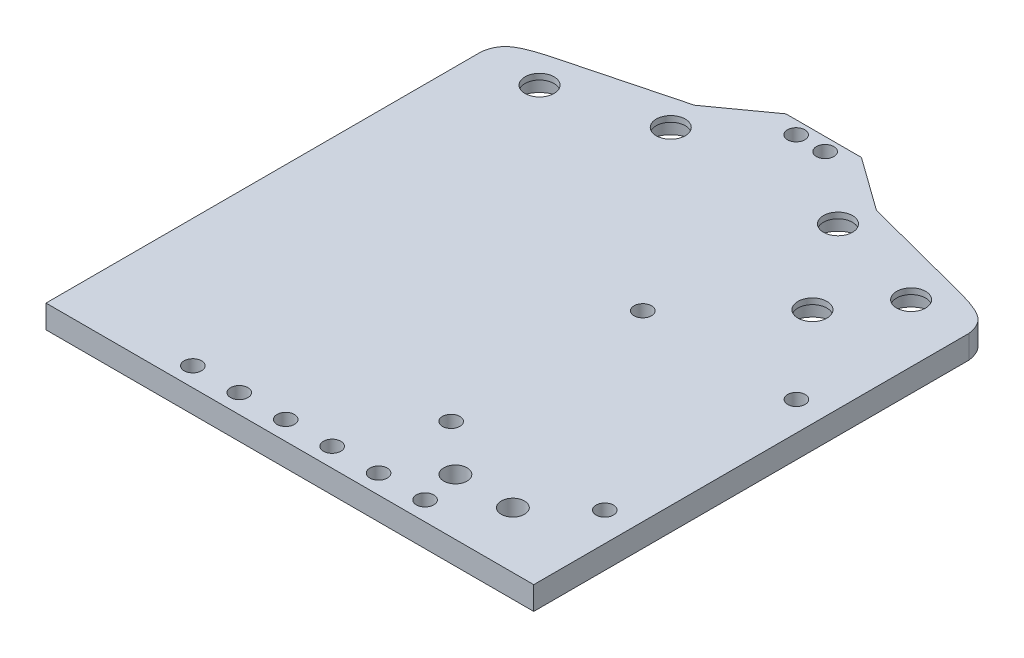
ISO-10303-21;
HEADER;
FILE_DESCRIPTION(('STEP AP214'),'2;1');
FILE_NAME('part.step','',(''),(''),'','','');
FILE_SCHEMA(('AUTOMOTIVE_DESIGN { 1 0 10303 214 1 1 1 1 }'));
ENDSEC;
DATA;
#1=APPLICATION_CONTEXT('core data for automotive mechanical design processes');
#2=APPLICATION_PROTOCOL_DEFINITION('international standard','automotive_design',2000,#1);
#3=PRODUCT_CONTEXT('',#1,'mechanical');
#4=PRODUCT('Part','Part','',(#3));
#5=PRODUCT_RELATED_PRODUCT_CATEGORY('part','',(#4));
#6=PRODUCT_DEFINITION_FORMATION('','',#4);
#7=PRODUCT_DEFINITION_CONTEXT('part definition',#1,'design');
#8=PRODUCT_DEFINITION('design','',#6,#7);
#9=PRODUCT_DEFINITION_SHAPE('','',#8);
#10=(LENGTH_UNIT() NAMED_UNIT(*) SI_UNIT(.MILLI.,.METRE.));
#11=(NAMED_UNIT(*) PLANE_ANGLE_UNIT() SI_UNIT($,.RADIAN.));
#12=(NAMED_UNIT(*) SI_UNIT($,.STERADIAN.) SOLID_ANGLE_UNIT());
#13=UNCERTAINTY_MEASURE_WITH_UNIT(LENGTH_MEASURE(1.E-05),#10,'distance_accuracy_value','');
#14=(GEOMETRIC_REPRESENTATION_CONTEXT(3) GLOBAL_UNCERTAINTY_ASSIGNED_CONTEXT((#13)) GLOBAL_UNIT_ASSIGNED_CONTEXT((#10,
#11,#12)) REPRESENTATION_CONTEXT('',''));
#15=CARTESIAN_POINT('',(0.,0.,0.));
#16=DIRECTION('',(0.,0.,1.));
#17=DIRECTION('',(1.,0.,0.));
#18=AXIS2_PLACEMENT_3D('',#15,#16,#17);
#19=CARTESIAN_POINT('',(0.,0.,0.));
#20=DIRECTION('',(0.,1.,0.));
#21=DIRECTION('',(0.,0.,1.));
#22=AXIS2_PLACEMENT_3D('',#19,#20,#21);
#23=PLANE('',#22);
#24=CARTESIAN_POINT('',(18.82,0.,70.31));
#25=DIRECTION('',(0.,-1.,0.));
#26=DIRECTION('',(0.,0.,-1.));
#27=AXIS2_PLACEMENT_3D('',#24,#25,#26);
#28=CIRCLE('',#27,2.);
#29=CARTESIAN_POINT('',(18.82,0.,68.31));
#30=VERTEX_POINT('',#29);
#31=EDGE_CURVE('E358',#30,#30,#28,.F.);
#32=ORIENTED_EDGE('',*,*,#31,.T.);
#33=EDGE_LOOP('',(#32));
#34=FACE_BOUND('',#33,.T.);
#35=CARTESIAN_POINT('',(28.72,0.,70.31));
#36=DIRECTION('',(0.,-1.,0.));
#37=DIRECTION('',(0.,0.,-1.));
#38=AXIS2_PLACEMENT_3D('',#35,#36,#37);
#39=CIRCLE('',#38,2.00000000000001);
#40=CARTESIAN_POINT('',(28.72,0.,68.31));
#41=VERTEX_POINT('',#40);
#42=EDGE_CURVE('E364',#41,#41,#39,.F.);
#43=ORIENTED_EDGE('',*,*,#42,.T.);
#44=EDGE_LOOP('',(#43));
#45=FACE_BOUND('',#44,.T.);
#46=CARTESIAN_POINT('',(37.0000000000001,0.,29.7600000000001));
#47=DIRECTION('',(0.,-1.,0.));
#48=DIRECTION('',(0.,0.,-1.));
#49=AXIS2_PLACEMENT_3D('',#46,#47,#48);
#50=CIRCLE('',#49,1.50000000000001);
#51=CARTESIAN_POINT('',(37.0000000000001,0.,28.2600000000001));
#52=VERTEX_POINT('',#51);
#53=EDGE_CURVE('E362',#52,#52,#50,.T.);
#54=ORIENTED_EDGE('',*,*,#53,.F.);
#55=EDGE_LOOP('',(#54));
#56=FACE_BOUND('',#55,.T.);
#57=CARTESIAN_POINT('',(10.54,0.,62.76));
#58=DIRECTION('',(0.,-1.,0.));
#59=DIRECTION('',(0.,0.,-1.));
#60=AXIS2_PLACEMENT_3D('',#57,#58,#59);
#61=CIRCLE('',#60,1.5);
#62=CARTESIAN_POINT('',(10.54,0.,61.26));
#63=VERTEX_POINT('',#62);
#64=EDGE_CURVE('E347',#63,#63,#61,.T.);
#65=ORIENTED_EDGE('',*,*,#64,.F.);
#66=EDGE_LOOP('',(#65));
#67=FACE_BOUND('',#66,.T.);
#68=CARTESIAN_POINT('',(-20.,0.,76.7166500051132));
#69=DIRECTION('',(0.,-1.,0.));
#70=DIRECTION('',(0.,0.,-1.));
#71=AXIS2_PLACEMENT_3D('',#68,#69,#70);
#72=CIRCLE('',#71,1.5);
#73=CARTESIAN_POINT('',(-20.,0.,75.2166500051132));
#74=VERTEX_POINT('',#73);
#75=EDGE_CURVE('E384',#74,#74,#72,.T.);
#76=ORIENTED_EDGE('',*,*,#75,.F.);
#77=EDGE_LOOP('',(#76));
#78=FACE_BOUND('',#77,.T.);
#79=CARTESIAN_POINT('',(-12.,0.,76.7166500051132));
#80=DIRECTION('',(0.,-1.,0.));
#81=DIRECTION('',(0.,0.,-1.));
#82=AXIS2_PLACEMENT_3D('',#79,#80,#81);
#83=CIRCLE('',#82,1.5);
#84=CARTESIAN_POINT('',(-12.,0.,75.2166500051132));
#85=VERTEX_POINT('',#84);
#86=EDGE_CURVE('E381',#85,#85,#83,.T.);
#87=ORIENTED_EDGE('',*,*,#86,.F.);
#88=EDGE_LOOP('',(#87));
#89=FACE_BOUND('',#88,.T.);
#90=CARTESIAN_POINT('',(-4.,0.,76.7166500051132));
#91=DIRECTION('',(0.,-1.,0.));
#92=DIRECTION('',(0.,0.,-1.));
#93=AXIS2_PLACEMENT_3D('',#90,#91,#92);
#94=CIRCLE('',#93,1.5);
#95=CARTESIAN_POINT('',(-4.,0.,75.2166500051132));
#96=VERTEX_POINT('',#95);
#97=EDGE_CURVE('E327',#96,#96,#94,.T.);
#98=ORIENTED_EDGE('',*,*,#97,.F.);
#99=EDGE_LOOP('',(#98));
#100=FACE_BOUND('',#99,.T.);
#101=CARTESIAN_POINT('',(32.,0.,5.));
#102=DIRECTION('',(0.,1.,0.));
#103=DIRECTION('',(0.,0.,1.));
#104=AXIS2_PLACEMENT_3D('',#101,#102,#103);
#105=CIRCLE('',#104,4.1);
#106=CARTESIAN_POINT('',(32.,0.,9.1));
#107=VERTEX_POINT('',#106);
#108=EDGE_CURVE('E409',#107,#107,#105,.F.);
#109=ORIENTED_EDGE('',*,*,#108,.F.);
#110=EDGE_LOOP('',(#109));
#111=FACE_BOUND('',#110,.T.);
#112=DIRECTION('',(-0.811997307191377,0.,-0.583661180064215));
#113=VECTOR('',#112,1.);
#114=CARTESIAN_POINT('',(7.87375522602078,0.,-10.9540744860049));
#115=LINE('',#114,#113);
#116=CARTESIAN_POINT('',(15.6674949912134,0.,-5.35195818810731));
#117=VERTEX_POINT('',#116);
#118=CARTESIAN_POINT('',(6.50166344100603,0.,-11.9403298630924));
#119=VERTEX_POINT('',#118);
#120=EDGE_CURVE('E298',#117,#119,#115,.T.);
#121=ORIENTED_EDGE('',*,*,#120,.F.);
#122=CARTESIAN_POINT('',(14.4,0.,0.));
#123=DIRECTION('',(0.,1.,0.));
#124=DIRECTION('',(0.,0.,1.));
#125=AXIS2_PLACEMENT_3D('',#122,#123,#124);
#126=CIRCLE('',#125,5.5);
#127=CARTESIAN_POINT('',(15.9139132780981,0.,-5.28753880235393));
#128=VERTEX_POINT('',#127);
#129=EDGE_CURVE('E296',#117,#128,#126,.F.);
#130=ORIENTED_EDGE('',*,*,#129,.T.);
#131=DIRECTION('',(-0.967486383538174,0.,-0.252923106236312));
#132=VECTOR('',#131,1.);
#133=CARTESIAN_POINT('',(2.31187354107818,0.,-8.84342361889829));
#134=LINE('',#133,#132);
#135=CARTESIAN_POINT('',(32.,0.,-1.0822671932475));
#136=VERTEX_POINT('',#135);
#137=EDGE_CURVE('E231',#136,#128,#134,.T.);
#138=ORIENTED_EDGE('',*,*,#137,.F.);
#139=CARTESIAN_POINT('',(32.,0.,-1.0822671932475));
#140=CARTESIAN_POINT('',(34.479638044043,0.,-0.458520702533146));
#141=CARTESIAN_POINT('',(39.7445832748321,0.,0.833673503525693));
#142=CARTESIAN_POINT('',(41.6503652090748,0.,2.84167312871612));
#143=CARTESIAN_POINT('',(42.,0.,4.99999999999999));
#144=B_SPLINE_CURVE_WITH_KNOTS('',3,(#139,#140,#141,#142,#143),.UNSPECIFIED.,.F.,.F.,(4,1,4),
(0.,0.499397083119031,1.),.UNSPECIFIED.);
#145=CARTESIAN_POINT('',(42.,0.,4.99999999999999));
#146=VERTEX_POINT('',#145);
#147=EDGE_CURVE('E287',#136,#146,#144,.T.);
#148=ORIENTED_EDGE('',*,*,#147,.T.);
#149=DIRECTION('',(0.,0.,1.));
#150=VECTOR('',#149,1.);
#151=CARTESIAN_POINT('',(42.,0.,0.));
#152=LINE('',#151,#150);
#153=CARTESIAN_POINT('',(42.,0.,80.));
#154=VERTEX_POINT('',#153);
#155=EDGE_CURVE('E284',#146,#154,#152,.T.);
#156=ORIENTED_EDGE('',*,*,#155,.T.);
#157=DIRECTION('',(1.,0.,0.));
#158=VECTOR('',#157,1.);
#159=CARTESIAN_POINT('',(0.,0.,80.));
#160=LINE('',#159,#158);
#161=CARTESIAN_POINT('',(-42.,0.,80.));
#162=VERTEX_POINT('',#161);
#163=EDGE_CURVE('E281',#162,#154,#160,.T.);
#164=ORIENTED_EDGE('',*,*,#163,.F.);
#165=DIRECTION('',(0.,0.,1.));
#166=VECTOR('',#165,1.);
#167=CARTESIAN_POINT('',(-42.,0.,0.));
#168=LINE('',#167,#166);
#169=CARTESIAN_POINT('',(-42.,0.,5.));
#170=VERTEX_POINT('',#169);
#171=EDGE_CURVE('E276',#170,#162,#168,.T.);
#172=ORIENTED_EDGE('',*,*,#171,.F.);
#173=CARTESIAN_POINT('',(-32.,0.,-1.08226719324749));
#174=CARTESIAN_POINT('',(-34.479638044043,0.,-0.458520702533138));
#175=CARTESIAN_POINT('',(-39.7445832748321,0.,0.833673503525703));
#176=CARTESIAN_POINT('',(-41.6503652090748,0.,2.84167312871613));
#177=CARTESIAN_POINT('',(-42.,0.,5.));
#178=B_SPLINE_CURVE_WITH_KNOTS('',3,(#173,#174,#175,#176,#177),.UNSPECIFIED.,.F.,.F.,(4,1,4),
(0.,0.499397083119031,1.),.UNSPECIFIED.);
#179=CARTESIAN_POINT('',(-32.,0.,-1.08226719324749));
#180=VERTEX_POINT('',#179);
#181=EDGE_CURVE('E272',#180,#170,#178,.T.);
#182=ORIENTED_EDGE('',*,*,#181,.F.);
#183=DIRECTION('',(0.967486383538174,0.,-0.252923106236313));
#184=VECTOR('',#183,1.);
#185=CARTESIAN_POINT('',(-2.31187354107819,0.,-8.8434236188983));
#186=LINE('',#185,#184);
#187=CARTESIAN_POINT('',(-15.6674949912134,0.,-5.35195818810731));
#188=VERTEX_POINT('',#187);
#189=EDGE_CURVE('E269',#180,#188,#186,.T.);
#190=ORIENTED_EDGE('',*,*,#189,.T.);
#191=DIRECTION('',(0.811997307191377,0.,-0.583661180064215));
#192=VECTOR('',#191,1.);
#193=CARTESIAN_POINT('',(-7.87375522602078,0.,-10.9540744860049));
#194=LINE('',#193,#192);
#195=CARTESIAN_POINT('',(-6.50166344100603,0.,-11.9403298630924));
#196=VERTEX_POINT('',#195);
#197=EDGE_CURVE('E265',#188,#196,#194,.T.);
#198=ORIENTED_EDGE('',*,*,#197,.T.);
#199=DIRECTION('',(1.,0.,0.));
#200=VECTOR('',#199,1.);
#201=CARTESIAN_POINT('',(0.,0.,-11.9403298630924));
#202=LINE('',#201,#200);
#203=EDGE_CURVE('E262',#196,#119,#202,.T.);
#204=ORIENTED_EDGE('',*,*,#203,.T.);
#205=EDGE_LOOP('',(#121,#130,#138,#148,#156,#164,#172,#182,#190,#198,#204));
#206=FACE_BOUND('',#205,.T.);
#207=CARTESIAN_POINT('',(-14.4,0.,0.));
#208=DIRECTION('',(0.,1.,0.));
#209=DIRECTION('',(0.,0.,1.));
#210=AXIS2_PLACEMENT_3D('',#207,#208,#209);
#211=CIRCLE('',#210,4.1);
#212=CARTESIAN_POINT('',(-14.4,0.,4.1));
#213=VERTEX_POINT('',#212);
#214=EDGE_CURVE('E427',#213,#213,#211,.T.);
#215=ORIENTED_EDGE('',*,*,#214,.T.);
#216=EDGE_LOOP('',(#215));
#217=FACE_BOUND('',#216,.T.);
#218=CARTESIAN_POINT('',(14.4,0.,0.));
#219=DIRECTION('',(0.,-1.,0.));
#220=DIRECTION('',(0.,0.,-1.));
#221=AXIS2_PLACEMENT_3D('',#218,#219,#220);
#222=CIRCLE('',#221,4.1);
#223=CARTESIAN_POINT('',(14.4,0.,-4.1));
#224=VERTEX_POINT('',#223);
#225=EDGE_CURVE('E417',#224,#224,#222,.T.);
#226=ORIENTED_EDGE('',*,*,#225,.F.);
#227=EDGE_LOOP('',(#226));
#228=FACE_BOUND('',#227,.T.);
#229=CARTESIAN_POINT('',(25.,0.,15.));
#230=DIRECTION('',(0.,1.,0.));
#231=DIRECTION('',(0.,0.,1.));
#232=AXIS2_PLACEMENT_3D('',#229,#230,#231);
#233=CIRCLE('',#232,4.1);
#234=CARTESIAN_POINT('',(25.,0.,19.1));
#235=VERTEX_POINT('',#234);
#236=EDGE_CURVE('E432',#235,#235,#233,.T.);
#237=ORIENTED_EDGE('',*,*,#236,.T.);
#238=EDGE_LOOP('',(#237));
#239=FACE_BOUND('',#238,.T.);
#240=CARTESIAN_POINT('',(-32.,0.,5.));
#241=DIRECTION('',(0.,1.,0.));
#242=DIRECTION('',(0.,0.,1.));
#243=AXIS2_PLACEMENT_3D('',#240,#241,#242);
#244=CIRCLE('',#243,4.1);
#245=CARTESIAN_POINT('',(-32.,0.,9.1));
#246=VERTEX_POINT('',#245);
#247=EDGE_CURVE('E424',#246,#246,#244,.T.);
#248=ORIENTED_EDGE('',*,*,#247,.T.);
#249=EDGE_LOOP('',(#248));
#250=FACE_BOUND('',#249,.T.);
#251=CARTESIAN_POINT('',(2.5,0.,-9.69032986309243));
#252=DIRECTION('',(0.,1.,0.));
#253=DIRECTION('',(0.,0.,1.));
#254=AXIS2_PLACEMENT_3D('',#251,#252,#253);
#255=CIRCLE('',#254,1.50083412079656);
#256=CARTESIAN_POINT('',(2.5,0.,-8.18949574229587));
#257=VERTEX_POINT('',#256);
#258=EDGE_CURVE('E404',#257,#257,#255,.F.);
#259=ORIENTED_EDGE('',*,*,#258,.F.);
#260=EDGE_LOOP('',(#259));
#261=FACE_BOUND('',#260,.T.);
#262=CARTESIAN_POINT('',(-2.5,0.,-9.69032986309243));
#263=DIRECTION('',(0.,1.,0.));
#264=DIRECTION('',(0.,0.,1.));
#265=AXIS2_PLACEMENT_3D('',#262,#263,#264);
#266=CIRCLE('',#265,1.50083412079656);
#267=CARTESIAN_POINT('',(-2.5,0.,-8.18949574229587));
#268=VERTEX_POINT('',#267);
#269=EDGE_CURVE('E397',#268,#268,#266,.T.);
#270=ORIENTED_EDGE('',*,*,#269,.T.);
#271=EDGE_LOOP('',(#270));
#272=FACE_BOUND('',#271,.T.);
#273=CARTESIAN_POINT('',(12.,0.,76.7166500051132));
#274=DIRECTION('',(0.,1.,0.));
#275=DIRECTION('',(0.,0.,1.));
#276=AXIS2_PLACEMENT_3D('',#273,#274,#275);
#277=CIRCLE('',#276,1.5);
#278=CARTESIAN_POINT('',(12.,0.,78.2166500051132));
#279=VERTEX_POINT('',#278);
#280=EDGE_CURVE('E385',#279,#279,#277,.T.);
#281=ORIENTED_EDGE('',*,*,#280,.T.);
#282=EDGE_LOOP('',(#281));
#283=FACE_BOUND('',#282,.T.);
#284=CARTESIAN_POINT('',(4.,0.,76.7166500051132));
#285=DIRECTION('',(0.,-1.,0.));
#286=DIRECTION('',(0.,0.,-1.));
#287=AXIS2_PLACEMENT_3D('',#284,#285,#286);
#288=CIRCLE('',#287,1.5);
#289=CARTESIAN_POINT('',(4.,0.,75.2166500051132));
#290=VERTEX_POINT('',#289);
#291=EDGE_CURVE('E388',#290,#290,#288,.F.);
#292=ORIENTED_EDGE('',*,*,#291,.T.);
#293=EDGE_LOOP('',(#292));
#294=FACE_BOUND('',#293,.T.);
#295=CARTESIAN_POINT('',(20.,0.,76.7166500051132));
#296=DIRECTION('',(0.,1.,0.));
#297=DIRECTION('',(0.,0.,1.));
#298=AXIS2_PLACEMENT_3D('',#295,#296,#297);
#299=CIRCLE('',#298,1.5);
#300=CARTESIAN_POINT('',(20.,0.,78.2166500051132));
#301=VERTEX_POINT('',#300);
#302=EDGE_CURVE('E355',#301,#301,#299,.T.);
#303=ORIENTED_EDGE('',*,*,#302,.T.);
#304=EDGE_LOOP('',(#303));
#305=FACE_BOUND('',#304,.T.);
#306=CARTESIAN_POINT('',(37.,0.,62.76));
#307=DIRECTION('',(0.,-1.,0.));
#308=DIRECTION('',(0.,0.,-1.));
#309=AXIS2_PLACEMENT_3D('',#306,#307,#308);
#310=CIRCLE('',#309,1.5);
#311=CARTESIAN_POINT('',(37.,0.,61.26));
#312=VERTEX_POINT('',#311);
#313=EDGE_CURVE('E373',#312,#312,#310,.F.);
#314=ORIENTED_EDGE('',*,*,#313,.T.);
#315=EDGE_LOOP('',(#314));
#316=FACE_BOUND('',#315,.T.);
#317=CARTESIAN_POINT('',(10.5400000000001,0.,29.7599999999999));
#318=DIRECTION('',(0.,-1.,0.));
#319=DIRECTION('',(0.,0.,-1.));
#320=AXIS2_PLACEMENT_3D('',#317,#318,#319);
#321=CIRCLE('',#320,1.5);
#322=CARTESIAN_POINT('',(10.5400000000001,0.,28.2599999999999));
#323=VERTEX_POINT('',#322);
#324=EDGE_CURVE('E374',#323,#323,#321,.F.);
#325=ORIENTED_EDGE('',*,*,#324,.T.);
#326=EDGE_LOOP('',(#325));
#327=FACE_BOUND('',#326,.T.);
#328=ADVANCED_FACE('F135',(#34,#45,#56,#67,#78,#89,#100,#111,#206,#217,#228,#239,#250,#261,#272,
#283,#294,#305,#316,#327),#23,.F.);
#329=CARTESIAN_POINT('',(0.,4.,0.));
#330=DIRECTION('',(0.,1.,0.));
#331=DIRECTION('',(0.,0.,1.));
#332=AXIS2_PLACEMENT_3D('',#329,#330,#331);
#333=PLANE('',#332);
#334=CARTESIAN_POINT('',(18.82,4.,70.31));
#335=DIRECTION('',(0.,1.,0.));
#336=DIRECTION('',(0.,0.,1.));
#337=AXIS2_PLACEMENT_3D('',#334,#335,#336);
#338=CIRCLE('',#337,2.);
#339=CARTESIAN_POINT('',(18.82,4.,72.31));
#340=VERTEX_POINT('',#339);
#341=EDGE_CURVE('E139',#340,#340,#338,.F.);
#342=ORIENTED_EDGE('',*,*,#341,.T.);
#343=EDGE_LOOP('',(#342));
#344=FACE_BOUND('',#343,.T.);
#345=CARTESIAN_POINT('',(28.72,4.,70.31));
#346=DIRECTION('',(0.,1.,0.));
#347=DIRECTION('',(0.,0.,1.));
#348=AXIS2_PLACEMENT_3D('',#345,#346,#347);
#349=CIRCLE('',#348,2.00000000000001);
#350=CARTESIAN_POINT('',(28.72,4.,72.31));
#351=VERTEX_POINT('',#350);
#352=EDGE_CURVE('E356',#351,#351,#349,.F.);
#353=ORIENTED_EDGE('',*,*,#352,.T.);
#354=EDGE_LOOP('',(#353));
#355=FACE_BOUND('',#354,.T.);
#356=CARTESIAN_POINT('',(37.,4.,62.76));
#357=DIRECTION('',(0.,1.,0.));
#358=DIRECTION('',(0.,0.,1.));
#359=AXIS2_PLACEMENT_3D('',#356,#357,#358);
#360=CIRCLE('',#359,1.5);
#361=CARTESIAN_POINT('',(37.,4.,64.26));
#362=VERTEX_POINT('',#361);
#363=EDGE_CURVE('E350',#362,#362,#360,.F.);
#364=ORIENTED_EDGE('',*,*,#363,.T.);
#365=EDGE_LOOP('',(#364));
#366=FACE_BOUND('',#365,.T.);
#367=CARTESIAN_POINT('',(37.0000000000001,4.,29.7600000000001));
#368=DIRECTION('',(0.,1.,0.));
#369=DIRECTION('',(0.,0.,1.));
#370=AXIS2_PLACEMENT_3D('',#367,#368,#369);
#371=CIRCLE('',#370,1.50000000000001);
#372=CARTESIAN_POINT('',(37.0000000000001,4.,31.2600000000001));
#373=VERTEX_POINT('',#372);
#374=EDGE_CURVE('E346',#373,#373,#371,.T.);
#375=ORIENTED_EDGE('',*,*,#374,.F.);
#376=EDGE_LOOP('',(#375));
#377=FACE_BOUND('',#376,.T.);
#378=CARTESIAN_POINT('',(10.54,4.,62.76));
#379=DIRECTION('',(0.,1.,0.));
#380=DIRECTION('',(0.,0.,1.));
#381=AXIS2_PLACEMENT_3D('',#378,#379,#380);
#382=CIRCLE('',#381,1.5);
#383=CARTESIAN_POINT('',(10.54,4.,64.26));
#384=VERTEX_POINT('',#383);
#385=EDGE_CURVE('E343',#384,#384,#382,.T.);
#386=ORIENTED_EDGE('',*,*,#385,.F.);
#387=EDGE_LOOP('',(#386));
#388=FACE_BOUND('',#387,.T.);
#389=CARTESIAN_POINT('',(4.,4.,76.7166500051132));
#390=DIRECTION('',(0.,1.,0.));
#391=DIRECTION('',(0.,0.,1.));
#392=AXIS2_PLACEMENT_3D('',#389,#390,#391);
#393=CIRCLE('',#392,1.5);
#394=CARTESIAN_POINT('',(4.,4.,78.2166500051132));
#395=VERTEX_POINT('',#394);
#396=EDGE_CURVE('E336',#395,#395,#393,.F.);
#397=ORIENTED_EDGE('',*,*,#396,.T.);
#398=EDGE_LOOP('',(#397));
#399=FACE_BOUND('',#398,.T.);
#400=CARTESIAN_POINT('',(-20.,4.,76.7166500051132));
#401=DIRECTION('',(0.,1.,0.));
#402=DIRECTION('',(0.,0.,1.));
#403=AXIS2_PLACEMENT_3D('',#400,#401,#402);
#404=CIRCLE('',#403,1.5);
#405=CARTESIAN_POINT('',(-20.,4.,78.2166500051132));
#406=VERTEX_POINT('',#405);
#407=EDGE_CURVE('E333',#406,#406,#404,.T.);
#408=ORIENTED_EDGE('',*,*,#407,.F.);
#409=EDGE_LOOP('',(#408));
#410=FACE_BOUND('',#409,.T.);
#411=CARTESIAN_POINT('',(-12.,4.,76.7166500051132));
#412=DIRECTION('',(0.,1.,0.));
#413=DIRECTION('',(0.,0.,1.));
#414=AXIS2_PLACEMENT_3D('',#411,#412,#413);
#415=CIRCLE('',#414,1.5);
#416=CARTESIAN_POINT('',(-12.,4.,78.2166500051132));
#417=VERTEX_POINT('',#416);
#418=EDGE_CURVE('E330',#417,#417,#415,.T.);
#419=ORIENTED_EDGE('',*,*,#418,.F.);
#420=EDGE_LOOP('',(#419));
#421=FACE_BOUND('',#420,.T.);
#422=CARTESIAN_POINT('',(-2.5,4.,-9.69032986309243));
#423=DIRECTION('',(0.,1.,0.));
#424=DIRECTION('',(0.,0.,1.));
#425=AXIS2_PLACEMENT_3D('',#422,#423,#424);
#426=CIRCLE('',#425,1.50083412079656);
#427=CARTESIAN_POINT('',(-2.5,4.,-8.18949574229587));
#428=VERTEX_POINT('',#427);
#429=EDGE_CURVE('E401',#428,#428,#426,.T.);
#430=ORIENTED_EDGE('',*,*,#429,.F.);
#431=EDGE_LOOP('',(#430));
#432=FACE_BOUND('',#431,.T.);
#433=CARTESIAN_POINT('',(14.4,4.,0.));
#434=DIRECTION('',(0.,-1.,0.));
#435=DIRECTION('',(0.,0.,-1.));
#436=AXIS2_PLACEMENT_3D('',#433,#434,#435);
#437=CIRCLE('',#436,2.5);
#438=CARTESIAN_POINT('',(14.4,4.,-2.5));
#439=VERTEX_POINT('',#438);
#440=EDGE_CURVE('E266',#439,#439,#437,.T.);
#441=ORIENTED_EDGE('',*,*,#440,.T.);
#442=EDGE_LOOP('',(#441));
#443=FACE_BOUND('',#442,.T.);
#444=CARTESIAN_POINT('',(-14.4,4.,0.));
#445=DIRECTION('',(0.,1.,0.));
#446=DIRECTION('',(0.,0.,1.));
#447=AXIS2_PLACEMENT_3D('',#444,#445,#446);
#448=CIRCLE('',#447,2.5);
#449=CARTESIAN_POINT('',(-14.4,4.,2.5));
#450=VERTEX_POINT('',#449);
#451=EDGE_CURVE('E259',#450,#450,#448,.T.);
#452=ORIENTED_EDGE('',*,*,#451,.F.);
#453=EDGE_LOOP('',(#452));
#454=FACE_BOUND('',#453,.T.);
#455=CARTESIAN_POINT('',(25.,4.,15.));
#456=DIRECTION('',(0.,1.,0.));
#457=DIRECTION('',(0.,0.,1.));
#458=AXIS2_PLACEMENT_3D('',#455,#456,#457);
#459=CIRCLE('',#458,2.5);
#460=CARTESIAN_POINT('',(25.,4.,17.5));
#461=VERTEX_POINT('',#460);
#462=EDGE_CURVE('E256',#461,#461,#459,.T.);
#463=ORIENTED_EDGE('',*,*,#462,.F.);
#464=EDGE_LOOP('',(#463));
#465=FACE_BOUND('',#464,.T.);
#466=CARTESIAN_POINT('',(-32.,4.,5.));
#467=DIRECTION('',(0.,1.,0.));
#468=DIRECTION('',(0.,0.,1.));
#469=AXIS2_PLACEMENT_3D('',#466,#467,#468);
#470=CIRCLE('',#469,2.5);
#471=CARTESIAN_POINT('',(-32.,4.,7.5));
#472=VERTEX_POINT('',#471);
#473=EDGE_CURVE('E253',#472,#472,#470,.T.);
#474=ORIENTED_EDGE('',*,*,#473,.F.);
#475=EDGE_LOOP('',(#474));
#476=FACE_BOUND('',#475,.T.);
#477=CARTESIAN_POINT('',(32.,4.,5.));
#478=DIRECTION('',(0.,1.,0.));
#479=DIRECTION('',(0.,0.,1.));
#480=AXIS2_PLACEMENT_3D('',#477,#478,#479);
#481=CIRCLE('',#480,2.5);
#482=CARTESIAN_POINT('',(32.,4.,7.5));
#483=VERTEX_POINT('',#482);
#484=EDGE_CURVE('E247',#483,#483,#481,.F.);
#485=ORIENTED_EDGE('',*,*,#484,.T.);
#486=EDGE_LOOP('',(#485));
#487=FACE_BOUND('',#486,.T.);
#488=DIRECTION('',(-0.967486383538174,0.,-0.252923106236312));
#489=VECTOR('',#488,1.);
#490=CARTESIAN_POINT('',(2.31187354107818,4.,-8.84342361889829));
#491=LINE('',#490,#489);
#492=CARTESIAN_POINT('',(32.,4.,-1.0822671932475));
#493=VERTEX_POINT('',#492);
#494=CARTESIAN_POINT('',(15.9139132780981,4.,-5.28753880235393));
#495=VERTEX_POINT('',#494);
#496=EDGE_CURVE('E228',#493,#495,#491,.T.);
#497=ORIENTED_EDGE('',*,*,#496,.T.);
#498=CARTESIAN_POINT('',(14.4,4.,0.));
#499=DIRECTION('',(0.,1.,0.));
#500=DIRECTION('',(0.,0.,1.));
#501=AXIS2_PLACEMENT_3D('',#498,#499,#500);
#502=CIRCLE('',#501,5.5);
#503=CARTESIAN_POINT('',(15.6674949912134,4.,-5.35195818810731));
#504=VERTEX_POINT('',#503);
#505=EDGE_CURVE('E240',#504,#495,#502,.F.);
#506=ORIENTED_EDGE('',*,*,#505,.F.);
#507=DIRECTION('',(-0.811997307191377,0.,-0.583661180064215));
#508=VECTOR('',#507,1.);
#509=CARTESIAN_POINT('',(7.87375522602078,4.,-10.9540744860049));
#510=LINE('',#509,#508);
#511=CARTESIAN_POINT('',(6.50166344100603,4.,-11.9403298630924));
#512=VERTEX_POINT('',#511);
#513=EDGE_CURVE('E154',#504,#512,#510,.T.);
#514=ORIENTED_EDGE('',*,*,#513,.T.);
#515=DIRECTION('',(1.,0.,0.));
#516=VECTOR('',#515,1.);
#517=CARTESIAN_POINT('',(0.,4.,-11.9403298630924));
#518=LINE('',#517,#516);
#519=CARTESIAN_POINT('',(-6.50166344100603,4.,-11.9403298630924));
#520=VERTEX_POINT('',#519);
#521=EDGE_CURVE('E300',#520,#512,#518,.T.);
#522=ORIENTED_EDGE('',*,*,#521,.F.);
#523=DIRECTION('',(0.811997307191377,0.,-0.583661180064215));
#524=VECTOR('',#523,1.);
#525=CARTESIAN_POINT('',(-7.87375522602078,4.,-10.9540744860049));
#526=LINE('',#525,#524);
#527=CARTESIAN_POINT('',(-15.6674949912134,4.,-5.35195818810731));
#528=VERTEX_POINT('',#527);
#529=EDGE_CURVE('E450',#528,#520,#526,.T.);
#530=ORIENTED_EDGE('',*,*,#529,.F.);
#531=DIRECTION('',(0.967486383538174,0.,-0.252923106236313));
#532=VECTOR('',#531,1.);
#533=CARTESIAN_POINT('',(-2.31187354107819,4.,-8.8434236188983));
#534=LINE('',#533,#532);
#535=CARTESIAN_POINT('',(-32.,4.,-1.08226719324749));
#536=VERTEX_POINT('',#535);
#537=EDGE_CURVE('E453',#536,#528,#534,.T.);
#538=ORIENTED_EDGE('',*,*,#537,.F.);
#539=CARTESIAN_POINT('',(-32.,4.,-1.08226719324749));
#540=CARTESIAN_POINT('',(-34.479638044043,4.,-0.458520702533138));
#541=CARTESIAN_POINT('',(-39.7445832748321,4.,0.833673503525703));
#542=CARTESIAN_POINT('',(-41.6503652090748,4.,2.84167312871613));
#543=CARTESIAN_POINT('',(-42.,4.,5.));
#544=B_SPLINE_CURVE_WITH_KNOTS('',3,(#539,#540,#541,#542,#543),.UNSPECIFIED.,.F.,.F.,(4,1,4),
(0.,0.499397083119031,1.),.UNSPECIFIED.);
#545=CARTESIAN_POINT('',(-42.,4.,5.));
#546=VERTEX_POINT('',#545);
#547=EDGE_CURVE('E456',#536,#546,#544,.T.);
#548=ORIENTED_EDGE('',*,*,#547,.T.);
#549=DIRECTION('',(0.,0.,1.));
#550=VECTOR('',#549,1.);
#551=CARTESIAN_POINT('',(-42.,4.,0.));
#552=LINE('',#551,#550);
#553=CARTESIAN_POINT('',(-42.,4.,80.));
#554=VERTEX_POINT('',#553);
#555=EDGE_CURVE('E461',#546,#554,#552,.T.);
#556=ORIENTED_EDGE('',*,*,#555,.T.);
#557=DIRECTION('',(1.,0.,0.));
#558=VECTOR('',#557,1.);
#559=CARTESIAN_POINT('',(0.,4.,80.));
#560=LINE('',#559,#558);
#561=CARTESIAN_POINT('',(42.,4.,80.));
#562=VERTEX_POINT('',#561);
#563=EDGE_CURVE('E533',#554,#562,#560,.T.);
#564=ORIENTED_EDGE('',*,*,#563,.T.);
#565=DIRECTION('',(0.,0.,1.));
#566=VECTOR('',#565,1.);
#567=CARTESIAN_POINT('',(42.,4.,0.));
#568=LINE('',#567,#566);
#569=CARTESIAN_POINT('',(42.,4.,4.99999999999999));
#570=VERTEX_POINT('',#569);
#571=EDGE_CURVE('E528',#570,#562,#568,.T.);
#572=ORIENTED_EDGE('',*,*,#571,.F.);
#573=CARTESIAN_POINT('',(32.,4.,-1.0822671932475));
#574=CARTESIAN_POINT('',(34.479638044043,4.,-0.458520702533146));
#575=CARTESIAN_POINT('',(39.7445832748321,4.,0.833673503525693));
#576=CARTESIAN_POINT('',(41.6503652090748,4.,2.84167312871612));
#577=CARTESIAN_POINT('',(42.,4.,4.99999999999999));
#578=B_SPLINE_CURVE_WITH_KNOTS('',3,(#573,#574,#575,#576,#577),.UNSPECIFIED.,.F.,.F.,(4,1,4),
(0.,0.499397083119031,1.),.UNSPECIFIED.);
#579=EDGE_CURVE('E243',#493,#570,#578,.T.);
#580=ORIENTED_EDGE('',*,*,#579,.F.);
#581=EDGE_LOOP('',(#497,#506,#514,#522,#530,#538,#548,#556,#564,#572,#580));
#582=FACE_BOUND('',#581,.T.);
#583=CARTESIAN_POINT('',(2.5,4.,-9.69032986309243));
#584=DIRECTION('',(0.,1.,0.));
#585=DIRECTION('',(0.,0.,1.));
#586=AXIS2_PLACEMENT_3D('',#583,#584,#585);
#587=CIRCLE('',#586,1.50083412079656);
#588=CARTESIAN_POINT('',(2.5,4.,-8.18949574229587));
#589=VERTEX_POINT('',#588);
#590=EDGE_CURVE('E342',#589,#589,#587,.F.);
#591=ORIENTED_EDGE('',*,*,#590,.T.);
#592=EDGE_LOOP('',(#591));
#593=FACE_BOUND('',#592,.T.);
#594=CARTESIAN_POINT('',(-4.,4.,76.7166500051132));
#595=DIRECTION('',(0.,1.,0.));
#596=DIRECTION('',(0.,0.,1.));
#597=AXIS2_PLACEMENT_3D('',#594,#595,#596);
#598=CIRCLE('',#597,1.5);
#599=CARTESIAN_POINT('',(-4.,4.,78.2166500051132));
#600=VERTEX_POINT('',#599);
#601=EDGE_CURVE('E323',#600,#600,#598,.T.);
#602=ORIENTED_EDGE('',*,*,#601,.F.);
#603=EDGE_LOOP('',(#602));
#604=FACE_BOUND('',#603,.T.);
#605=CARTESIAN_POINT('',(12.,4.,76.7166500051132));
#606=DIRECTION('',(0.,1.,0.));
#607=DIRECTION('',(0.,0.,1.));
#608=AXIS2_PLACEMENT_3D('',#605,#606,#607);
#609=CIRCLE('',#608,1.5);
#610=CARTESIAN_POINT('',(12.,4.,78.2166500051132));
#611=VERTEX_POINT('',#610);
#612=EDGE_CURVE('E326',#611,#611,#609,.F.);
#613=ORIENTED_EDGE('',*,*,#612,.T.);
#614=EDGE_LOOP('',(#613));
#615=FACE_BOUND('',#614,.T.);
#616=CARTESIAN_POINT('',(20.,4.,76.7166500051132));
#617=DIRECTION('',(0.,1.,0.));
#618=DIRECTION('',(0.,0.,1.));
#619=AXIS2_PLACEMENT_3D('',#616,#617,#618);
#620=CIRCLE('',#619,1.5);
#621=CARTESIAN_POINT('',(20.,4.,78.2166500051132));
#622=VERTEX_POINT('',#621);
#623=EDGE_CURVE('E339',#622,#622,#620,.F.);
#624=ORIENTED_EDGE('',*,*,#623,.T.);
#625=EDGE_LOOP('',(#624));
#626=FACE_BOUND('',#625,.T.);
#627=CARTESIAN_POINT('',(10.5400000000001,4.,29.7599999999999));
#628=DIRECTION('',(0.,1.,0.));
#629=DIRECTION('',(0.,0.,1.));
#630=AXIS2_PLACEMENT_3D('',#627,#628,#629);
#631=CIRCLE('',#630,1.5);
#632=CARTESIAN_POINT('',(10.5400000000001,4.,31.2599999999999));
#633=VERTEX_POINT('',#632);
#634=EDGE_CURVE('E353',#633,#633,#631,.F.);
#635=ORIENTED_EDGE('',*,*,#634,.T.);
#636=EDGE_LOOP('',(#635));
#637=FACE_BOUND('',#636,.T.);
#638=ADVANCED_FACE('F238',(#344,#355,#366,#377,#388,#399,#410,#421,#432,#443,#454,#465,#476,
#487,#582,#593,#604,#615,#626,#637),#333,.T.);
#639=CARTESIAN_POINT('',(14.4,4.,0.));
#640=DIRECTION('',(0.,-1.,0.));
#641=DIRECTION('',(0.,0.,-1.));
#642=AXIS2_PLACEMENT_3D('',#639,#640,#641);
#643=CYLINDRICAL_SURFACE('',#642,2.5);
#644=ORIENTED_EDGE('',*,*,#440,.F.);
#645=EDGE_LOOP('',(#644));
#646=FACE_BOUND('',#645,.T.);
#647=CARTESIAN_POINT('',(14.4,3.,0.));
#648=DIRECTION('',(0.,-1.,0.));
#649=DIRECTION('',(0.,0.,-1.));
#650=AXIS2_PLACEMENT_3D('',#647,#648,#649);
#651=CIRCLE('',#650,2.5);
#652=CARTESIAN_POINT('',(14.4,3.,-2.5));
#653=VERTEX_POINT('',#652);
#654=EDGE_CURVE('E319',#653,#653,#651,.F.);
#655=ORIENTED_EDGE('',*,*,#654,.F.);
#656=EDGE_LOOP('',(#655));
#657=FACE_BOUND('',#656,.T.);
#658=ADVANCED_FACE('F137',(#646,#657),#643,.F.);
#659=CARTESIAN_POINT('',(14.4,4.,0.));
#660=DIRECTION('',(0.,-1.,0.));
#661=DIRECTION('',(0.,0.,-1.));
#662=AXIS2_PLACEMENT_3D('',#659,#660,#661);
#663=CYLINDRICAL_SURFACE('',#662,5.5);
#664=ORIENTED_EDGE('',*,*,#129,.F.);
#665=DIRECTION('',(0.,-1.,0.));
#666=VECTOR('',#665,1.);
#667=CARTESIAN_POINT('',(15.6674949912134,4.,-5.35195818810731));
#668=LINE('',#667,#666);
#669=EDGE_CURVE('E190',#504,#117,#668,.T.);
#670=ORIENTED_EDGE('',*,*,#669,.F.);
#671=ORIENTED_EDGE('',*,*,#505,.T.);
#672=DIRECTION('',(0.,-1.,0.));
#673=VECTOR('',#672,1.);
#674=CARTESIAN_POINT('',(15.9139132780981,4.,-5.28753880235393));
#675=LINE('',#674,#673);
#676=EDGE_CURVE('E225',#495,#128,#675,.T.);
#677=ORIENTED_EDGE('',*,*,#676,.T.);
#678=EDGE_LOOP('',(#664,#670,#671,#677));
#679=FACE_BOUND('',#678,.T.);
#680=ADVANCED_FACE('F245',(#679),#663,.T.);
#681=CARTESIAN_POINT('',(-14.4,4.,0.));
#682=DIRECTION('',(0.,-1.,0.));
#683=DIRECTION('',(0.,0.,-1.));
#684=AXIS2_PLACEMENT_3D('',#681,#682,#683);
#685=CYLINDRICAL_SURFACE('',#684,2.5);
#686=CARTESIAN_POINT('',(-14.4,3.,0.));
#687=DIRECTION('',(0.,1.,0.));
#688=DIRECTION('',(0.,0.,1.));
#689=AXIS2_PLACEMENT_3D('',#686,#687,#688);
#690=CIRCLE('',#689,2.5);
#691=CARTESIAN_POINT('',(-14.4,3.,2.5));
#692=VERTEX_POINT('',#691);
#693=EDGE_CURVE('E442',#692,#692,#690,.T.);
#694=ORIENTED_EDGE('',*,*,#693,.F.);
#695=EDGE_LOOP('',(#694));
#696=FACE_BOUND('',#695,.T.);
#697=ORIENTED_EDGE('',*,*,#451,.T.);
#698=EDGE_LOOP('',(#697));
#699=FACE_BOUND('',#698,.T.);
#700=ADVANCED_FACE('F500',(#696,#699),#685,.F.);
#701=CARTESIAN_POINT('',(25.,4.,15.));
#702=DIRECTION('',(0.,-1.,0.));
#703=DIRECTION('',(0.,0.,-1.));
#704=AXIS2_PLACEMENT_3D('',#701,#702,#703);
#705=CYLINDRICAL_SURFACE('',#704,2.5);
#706=CARTESIAN_POINT('',(25.,3.,15.));
#707=DIRECTION('',(0.,1.,0.));
#708=DIRECTION('',(0.,0.,1.));
#709=AXIS2_PLACEMENT_3D('',#706,#707,#708);
#710=CIRCLE('',#709,2.5);
#711=CARTESIAN_POINT('',(25.,3.,17.5));
#712=VERTEX_POINT('',#711);
#713=EDGE_CURVE('E412',#712,#712,#710,.T.);
#714=ORIENTED_EDGE('',*,*,#713,.F.);
#715=EDGE_LOOP('',(#714));
#716=FACE_BOUND('',#715,.T.);
#717=ORIENTED_EDGE('',*,*,#462,.T.);
#718=EDGE_LOOP('',(#717));
#719=FACE_BOUND('',#718,.T.);
#720=ADVANCED_FACE('F503',(#716,#719),#705,.F.);
#721=CARTESIAN_POINT('',(-32.,4.,5.));
#722=DIRECTION('',(0.,-1.,0.));
#723=DIRECTION('',(0.,0.,-1.));
#724=AXIS2_PLACEMENT_3D('',#721,#722,#723);
#725=CYLINDRICAL_SURFACE('',#724,2.5);
#726=CARTESIAN_POINT('',(-32.,3.,5.));
#727=DIRECTION('',(0.,1.,0.));
#728=DIRECTION('',(0.,0.,1.));
#729=AXIS2_PLACEMENT_3D('',#726,#727,#728);
#730=CIRCLE('',#729,2.5);
#731=CARTESIAN_POINT('',(-32.,3.,7.5));
#732=VERTEX_POINT('',#731);
#733=EDGE_CURVE('E428',#732,#732,#730,.T.);
#734=ORIENTED_EDGE('',*,*,#733,.F.);
#735=EDGE_LOOP('',(#734));
#736=FACE_BOUND('',#735,.T.);
#737=ORIENTED_EDGE('',*,*,#473,.T.);
#738=EDGE_LOOP('',(#737));
#739=FACE_BOUND('',#738,.T.);
#740=ADVANCED_FACE('F487',(#736,#739),#725,.F.);
#741=CARTESIAN_POINT('',(32.,4.,5.));
#742=DIRECTION('',(0.,-1.,0.));
#743=DIRECTION('',(0.,0.,-1.));
#744=AXIS2_PLACEMENT_3D('',#741,#742,#743);
#745=CYLINDRICAL_SURFACE('',#744,2.5);
#746=CARTESIAN_POINT('',(32.,3.,5.));
#747=DIRECTION('',(0.,1.,0.));
#748=DIRECTION('',(0.,0.,1.));
#749=AXIS2_PLACEMENT_3D('',#746,#747,#748);
#750=CIRCLE('',#749,2.5);
#751=CARTESIAN_POINT('',(32.,3.,7.5));
#752=VERTEX_POINT('',#751);
#753=EDGE_CURVE('E414',#752,#752,#750,.F.);
#754=ORIENTED_EDGE('',*,*,#753,.T.);
#755=EDGE_LOOP('',(#754));
#756=FACE_BOUND('',#755,.T.);
#757=ORIENTED_EDGE('',*,*,#484,.F.);
#758=EDGE_LOOP('',(#757));
#759=FACE_BOUND('',#758,.T.);
#760=ADVANCED_FACE('F483',(#756,#759),#745,.F.);
#761=CARTESIAN_POINT('',(0.,4.,-11.9403298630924));
#762=DIRECTION('',(0.,0.,-1.));
#763=DIRECTION('',(-1.,0.,0.));
#764=AXIS2_PLACEMENT_3D('',#761,#762,#763);
#765=PLANE('',#764);
#766=ORIENTED_EDGE('',*,*,#203,.F.);
#767=DIRECTION('',(0.,-1.,0.));
#768=VECTOR('',#767,1.);
#769=CARTESIAN_POINT('',(-6.50166344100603,4.,-11.9403298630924));
#770=LINE('',#769,#768);
#771=EDGE_CURVE('E12',#520,#196,#770,.T.);
#772=ORIENTED_EDGE('',*,*,#771,.F.);
#773=ORIENTED_EDGE('',*,*,#521,.T.);
#774=DIRECTION('',(0.,-1.,0.));
#775=VECTOR('',#774,1.);
#776=CARTESIAN_POINT('',(6.50166344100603,4.,-11.9403298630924));
#777=LINE('',#776,#775);
#778=EDGE_CURVE('E197',#512,#119,#777,.T.);
#779=ORIENTED_EDGE('',*,*,#778,.T.);
#780=EDGE_LOOP('',(#766,#772,#773,#779));
#781=FACE_BOUND('',#780,.T.);
#782=ADVANCED_FACE('F480',(#781),#765,.T.);
#783=CARTESIAN_POINT('',(-7.87375522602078,4.,-10.9540744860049));
#784=DIRECTION('',(-0.583661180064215,0.,-0.811997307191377));
#785=DIRECTION('',(-0.811997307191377,0.,0.583661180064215));
#786=AXIS2_PLACEMENT_3D('',#783,#784,#785);
#787=PLANE('',#786);
#788=ORIENTED_EDGE('',*,*,#197,.F.);
#789=DIRECTION('',(0.,-1.,0.));
#790=VECTOR('',#789,1.);
#791=CARTESIAN_POINT('',(-15.6674949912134,4.,-5.35195818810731));
#792=LINE('',#791,#790);
#793=EDGE_CURVE('E145',#528,#188,#792,.T.);
#794=ORIENTED_EDGE('',*,*,#793,.F.);
#795=ORIENTED_EDGE('',*,*,#529,.T.);
#796=ORIENTED_EDGE('',*,*,#771,.T.);
#797=EDGE_LOOP('',(#788,#794,#795,#796));
#798=FACE_BOUND('',#797,.T.);
#799=ADVANCED_FACE('F477',(#798),#787,.T.);
#800=CARTESIAN_POINT('',(-2.31187354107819,4.,-8.8434236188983));
#801=DIRECTION('',(-0.252923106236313,0.,-0.967486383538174));
#802=DIRECTION('',(-0.967486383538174,0.,0.252923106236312));
#803=AXIS2_PLACEMENT_3D('',#800,#801,#802);
#804=PLANE('',#803);
#805=ORIENTED_EDGE('',*,*,#189,.F.);
#806=DIRECTION('',(0.,-1.,0.));
#807=VECTOR('',#806,1.);
#808=CARTESIAN_POINT('',(-32.,4.,-1.08226719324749));
#809=LINE('',#808,#807);
#810=EDGE_CURVE('E314',#536,#180,#809,.T.);
#811=ORIENTED_EDGE('',*,*,#810,.F.);
#812=ORIENTED_EDGE('',*,*,#537,.T.);
#813=ORIENTED_EDGE('',*,*,#793,.T.);
#814=EDGE_LOOP('',(#805,#811,#812,#813));
#815=FACE_BOUND('',#814,.T.);
#816=ADVANCED_FACE('F472',(#815),#804,.T.);
#817=DIRECTION('',(0.,-1.,0.));
#818=VECTOR('',#817,1.);
#819=SURFACE_OF_LINEAR_EXTRUSION('',#544,#818);
#820=ORIENTED_EDGE('',*,*,#181,.T.);
#821=DIRECTION('',(0.,-1.,0.));
#822=VECTOR('',#821,1.);
#823=CARTESIAN_POINT('',(-42.,4.,5.));
#824=LINE('',#823,#822);
#825=EDGE_CURVE('E311',#546,#170,#824,.T.);
#826=ORIENTED_EDGE('',*,*,#825,.F.);
#827=ORIENTED_EDGE('',*,*,#547,.F.);
#828=ORIENTED_EDGE('',*,*,#810,.T.);
#829=EDGE_LOOP('',(#820,#826,#827,#828));
#830=FACE_BOUND('',#829,.T.);
#831=ADVANCED_FACE('F467',(#830),#819,.F.);
#832=CARTESIAN_POINT('',(-42.,4.,0.));
#833=DIRECTION('',(1.,0.,0.));
#834=DIRECTION('',(0.,0.,-1.));
#835=AXIS2_PLACEMENT_3D('',#832,#833,#834);
#836=PLANE('',#835);
#837=ORIENTED_EDGE('',*,*,#171,.T.);
#838=DIRECTION('',(0.,-1.,0.));
#839=VECTOR('',#838,1.);
#840=CARTESIAN_POINT('',(-42.,4.,80.));
#841=LINE('',#840,#839);
#842=EDGE_CURVE('E308',#554,#162,#841,.T.);
#843=ORIENTED_EDGE('',*,*,#842,.F.);
#844=ORIENTED_EDGE('',*,*,#555,.F.);
#845=ORIENTED_EDGE('',*,*,#825,.T.);
#846=EDGE_LOOP('',(#837,#843,#844,#845));
#847=FACE_BOUND('',#846,.T.);
#848=ADVANCED_FACE('F471',(#847),#836,.F.);
#849=CARTESIAN_POINT('',(0.,4.,80.));
#850=DIRECTION('',(0.,0.,-1.));
#851=DIRECTION('',(-1.,0.,0.));
#852=AXIS2_PLACEMENT_3D('',#849,#850,#851);
#853=PLANE('',#852);
#854=ORIENTED_EDGE('',*,*,#163,.T.);
#855=DIRECTION('',(0.,-1.,0.));
#856=VECTOR('',#855,1.);
#857=CARTESIAN_POINT('',(42.,4.,80.));
#858=LINE('',#857,#856);
#859=EDGE_CURVE('E306',#562,#154,#858,.T.);
#860=ORIENTED_EDGE('',*,*,#859,.F.);
#861=ORIENTED_EDGE('',*,*,#563,.F.);
#862=ORIENTED_EDGE('',*,*,#842,.T.);
#863=EDGE_LOOP('',(#854,#860,#861,#862));
#864=FACE_BOUND('',#863,.T.);
#865=ADVANCED_FACE('F545',(#864),#853,.F.);
#866=CARTESIAN_POINT('',(42.,4.,0.));
#867=DIRECTION('',(1.,0.,0.));
#868=DIRECTION('',(0.,0.,-1.));
#869=AXIS2_PLACEMENT_3D('',#866,#867,#868);
#870=PLANE('',#869);
#871=ORIENTED_EDGE('',*,*,#155,.F.);
#872=DIRECTION('',(0.,-1.,0.));
#873=VECTOR('',#872,1.);
#874=CARTESIAN_POINT('',(42.,4.,4.99999999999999));
#875=LINE('',#874,#873);
#876=EDGE_CURVE('E304',#570,#146,#875,.T.);
#877=ORIENTED_EDGE('',*,*,#876,.F.);
#878=ORIENTED_EDGE('',*,*,#571,.T.);
#879=ORIENTED_EDGE('',*,*,#859,.T.);
#880=EDGE_LOOP('',(#871,#877,#878,#879));
#881=FACE_BOUND('',#880,.T.);
#882=ADVANCED_FACE('F522',(#881),#870,.T.);
#883=DIRECTION('',(0.,-1.,0.));
#884=VECTOR('',#883,1.);
#885=SURFACE_OF_LINEAR_EXTRUSION('',#578,#884);
#886=ORIENTED_EDGE('',*,*,#147,.F.);
#887=DIRECTION('',(0.,-1.,0.));
#888=VECTOR('',#887,1.);
#889=CARTESIAN_POINT('',(32.,4.,-1.0822671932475));
#890=LINE('',#889,#888);
#891=EDGE_CURVE('E236',#493,#136,#890,.T.);
#892=ORIENTED_EDGE('',*,*,#891,.F.);
#893=ORIENTED_EDGE('',*,*,#579,.T.);
#894=ORIENTED_EDGE('',*,*,#876,.T.);
#895=EDGE_LOOP('',(#886,#892,#893,#894));
#896=FACE_BOUND('',#895,.T.);
#897=ADVANCED_FACE('F519',(#896),#885,.T.);
#898=CARTESIAN_POINT('',(2.31187354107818,4.,-8.84342361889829));
#899=DIRECTION('',(-0.252923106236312,0.,0.967486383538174));
#900=DIRECTION('',(0.967486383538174,0.,0.252923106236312));
#901=AXIS2_PLACEMENT_3D('',#898,#899,#900);
#902=PLANE('',#901);
#903=ORIENTED_EDGE('',*,*,#137,.T.);
#904=ORIENTED_EDGE('',*,*,#676,.F.);
#905=ORIENTED_EDGE('',*,*,#496,.F.);
#906=ORIENTED_EDGE('',*,*,#891,.T.);
#907=EDGE_LOOP('',(#903,#904,#905,#906));
#908=FACE_BOUND('',#907,.T.);
#909=ADVANCED_FACE('F227',(#908),#902,.F.);
#910=CARTESIAN_POINT('',(7.87375522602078,4.,-10.9540744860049));
#911=DIRECTION('',(-0.583661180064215,0.,0.811997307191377));
#912=DIRECTION('',(0.811997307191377,0.,0.583661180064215));
#913=AXIS2_PLACEMENT_3D('',#910,#911,#912);
#914=PLANE('',#913);
#915=ORIENTED_EDGE('',*,*,#120,.T.);
#916=ORIENTED_EDGE('',*,*,#778,.F.);
#917=ORIENTED_EDGE('',*,*,#513,.F.);
#918=ORIENTED_EDGE('',*,*,#669,.T.);
#919=EDGE_LOOP('',(#915,#916,#917,#918));
#920=FACE_BOUND('',#919,.T.);
#921=ADVANCED_FACE('F511',(#920),#914,.F.);
#922=CARTESIAN_POINT('',(14.4,3.,0.));
#923=DIRECTION('',(0.,-1.,0.));
#924=DIRECTION('',(0.,0.,-1.));
#925=AXIS2_PLACEMENT_3D('',#922,#923,#924);
#926=PLANE('',#925);
#927=CARTESIAN_POINT('',(14.4,3.,0.));
#928=DIRECTION('',(0.,-1.,0.));
#929=DIRECTION('',(0.,0.,-1.));
#930=AXIS2_PLACEMENT_3D('',#927,#928,#929);
#931=CIRCLE('',#930,4.1);
#932=CARTESIAN_POINT('',(14.4,3.,-4.1));
#933=VERTEX_POINT('',#932);
#934=EDGE_CURVE('E400',#933,#933,#931,.T.);
#935=ORIENTED_EDGE('',*,*,#934,.T.);
#936=EDGE_LOOP('',(#935));
#937=FACE_BOUND('',#936,.T.);
#938=ORIENTED_EDGE('',*,*,#654,.T.);
#939=EDGE_LOOP('',(#938));
#940=FACE_BOUND('',#939,.T.);
#941=ADVANCED_FACE('F514',(#937,#940),#926,.T.);
#942=CARTESIAN_POINT('',(14.4,3.,0.));
#943=DIRECTION('',(0.,-1.,0.));
#944=DIRECTION('',(0.,0.,-1.));
#945=AXIS2_PLACEMENT_3D('',#942,#943,#944);
#946=CYLINDRICAL_SURFACE('',#945,4.1);
#947=ORIENTED_EDGE('',*,*,#934,.F.);
#948=EDGE_LOOP('',(#947));
#949=FACE_BOUND('',#948,.T.);
#950=ORIENTED_EDGE('',*,*,#225,.T.);
#951=EDGE_LOOP('',(#950));
#952=FACE_BOUND('',#951,.T.);
#953=ADVANCED_FACE('F643',(#949,#952),#946,.F.);
#954=CARTESIAN_POINT('',(-14.4,3.,0.));
#955=DIRECTION('',(0.,-1.,0.));
#956=DIRECTION('',(0.,0.,-1.));
#957=AXIS2_PLACEMENT_3D('',#954,#955,#956);
#958=CYLINDRICAL_SURFACE('',#957,4.1);
#959=CARTESIAN_POINT('',(-14.4,3.,0.));
#960=DIRECTION('',(0.,1.,0.));
#961=DIRECTION('',(0.,0.,1.));
#962=AXIS2_PLACEMENT_3D('',#959,#960,#961);
#963=CIRCLE('',#962,4.1);
#964=CARTESIAN_POINT('',(-14.4,3.,4.1));
#965=VERTEX_POINT('',#964);
#966=EDGE_CURVE('E322',#965,#965,#963,.T.);
#967=ORIENTED_EDGE('',*,*,#966,.T.);
#968=EDGE_LOOP('',(#967));
#969=FACE_BOUND('',#968,.T.);
#970=ORIENTED_EDGE('',*,*,#214,.F.);
#971=EDGE_LOOP('',(#970));
#972=FACE_BOUND('',#971,.T.);
#973=ADVANCED_FACE('F646',(#969,#972),#958,.F.);
#974=CARTESIAN_POINT('',(0.,3.,0.));
#975=DIRECTION('',(0.,1.,0.));
#976=DIRECTION('',(0.,0.,1.));
#977=AXIS2_PLACEMENT_3D('',#974,#975,#976);
#978=PLANE('',#977);
#979=ORIENTED_EDGE('',*,*,#693,.T.);
#980=EDGE_LOOP('',(#979));
#981=FACE_BOUND('',#980,.T.);
#982=ORIENTED_EDGE('',*,*,#966,.F.);
#983=EDGE_LOOP('',(#982));
#984=FACE_BOUND('',#983,.T.);
#985=ADVANCED_FACE('F637',(#981,#984),#978,.F.);
#986=CARTESIAN_POINT('',(32.,3.,5.));
#987=DIRECTION('',(0.,-1.,0.));
#988=DIRECTION('',(0.,0.,-1.));
#989=AXIS2_PLACEMENT_3D('',#986,#987,#988);
#990=CYLINDRICAL_SURFACE('',#989,4.1);
#991=CARTESIAN_POINT('',(32.,3.,5.));
#992=DIRECTION('',(0.,1.,0.));
#993=DIRECTION('',(0.,0.,1.));
#994=AXIS2_PLACEMENT_3D('',#991,#992,#993);
#995=CIRCLE('',#994,4.1);
#996=CARTESIAN_POINT('',(32.,3.,9.1));
#997=VERTEX_POINT('',#996);
#998=EDGE_CURVE('E413',#997,#997,#995,.F.);
#999=ORIENTED_EDGE('',*,*,#998,.F.);
#1000=EDGE_LOOP('',(#999));
#1001=FACE_BOUND('',#1000,.T.);
#1002=ORIENTED_EDGE('',*,*,#108,.T.);
#1003=EDGE_LOOP('',(#1002));
#1004=FACE_BOUND('',#1003,.T.);
#1005=ADVANCED_FACE('F633',(#1001,#1004),#990,.F.);
#1006=CARTESIAN_POINT('',(0.,3.,0.));
#1007=DIRECTION('',(0.,1.,0.));
#1008=DIRECTION('',(0.,0.,1.));
#1009=AXIS2_PLACEMENT_3D('',#1006,#1007,#1008);
#1010=PLANE('',#1009);
#1011=ORIENTED_EDGE('',*,*,#998,.T.);
#1012=EDGE_LOOP('',(#1011));
#1013=FACE_BOUND('',#1012,.T.);
#1014=ORIENTED_EDGE('',*,*,#753,.F.);
#1015=EDGE_LOOP('',(#1014));
#1016=FACE_BOUND('',#1015,.T.);
#1017=ADVANCED_FACE('F636',(#1013,#1016),#1010,.F.);
#1018=CARTESIAN_POINT('',(25.,3.,15.));
#1019=DIRECTION('',(0.,-1.,0.));
#1020=DIRECTION('',(0.,0.,-1.));
#1021=AXIS2_PLACEMENT_3D('',#1018,#1019,#1020);
#1022=CYLINDRICAL_SURFACE('',#1021,4.1);
#1023=CARTESIAN_POINT('',(25.,3.,15.));
#1024=DIRECTION('',(0.,1.,0.));
#1025=DIRECTION('',(0.,0.,1.));
#1026=AXIS2_PLACEMENT_3D('',#1023,#1024,#1025);
#1027=CIRCLE('',#1026,4.1);
#1028=CARTESIAN_POINT('',(25.,3.,19.1));
#1029=VERTEX_POINT('',#1028);
#1030=EDGE_CURVE('E437',#1029,#1029,#1027,.T.);
#1031=ORIENTED_EDGE('',*,*,#1030,.T.);
#1032=EDGE_LOOP('',(#1031));
#1033=FACE_BOUND('',#1032,.T.);
#1034=ORIENTED_EDGE('',*,*,#236,.F.);
#1035=EDGE_LOOP('',(#1034));
#1036=FACE_BOUND('',#1035,.T.);
#1037=ADVANCED_FACE('F641',(#1033,#1036),#1022,.F.);
#1038=CARTESIAN_POINT('',(0.,3.,0.));
#1039=DIRECTION('',(0.,1.,0.));
#1040=DIRECTION('',(0.,0.,1.));
#1041=AXIS2_PLACEMENT_3D('',#1038,#1039,#1040);
#1042=PLANE('',#1041);
#1043=ORIENTED_EDGE('',*,*,#1030,.F.);
#1044=EDGE_LOOP('',(#1043));
#1045=FACE_BOUND('',#1044,.T.);
#1046=ORIENTED_EDGE('',*,*,#713,.T.);
#1047=EDGE_LOOP('',(#1046));
#1048=FACE_BOUND('',#1047,.T.);
#1049=ADVANCED_FACE('F654',(#1045,#1048),#1042,.F.);
#1050=CARTESIAN_POINT('',(-32.,3.,5.));
#1051=DIRECTION('',(0.,-1.,0.));
#1052=DIRECTION('',(0.,0.,-1.));
#1053=AXIS2_PLACEMENT_3D('',#1050,#1051,#1052);
#1054=CYLINDRICAL_SURFACE('',#1053,4.1);
#1055=CARTESIAN_POINT('',(-32.,3.,5.));
#1056=DIRECTION('',(0.,1.,0.));
#1057=DIRECTION('',(0.,0.,1.));
#1058=AXIS2_PLACEMENT_3D('',#1055,#1056,#1057);
#1059=CIRCLE('',#1058,4.1);
#1060=CARTESIAN_POINT('',(-32.,3.,9.1));
#1061=VERTEX_POINT('',#1060);
#1062=EDGE_CURVE('E429',#1061,#1061,#1059,.T.);
#1063=ORIENTED_EDGE('',*,*,#1062,.T.);
#1064=EDGE_LOOP('',(#1063));
#1065=FACE_BOUND('',#1064,.T.);
#1066=ORIENTED_EDGE('',*,*,#247,.F.);
#1067=EDGE_LOOP('',(#1066));
#1068=FACE_BOUND('',#1067,.T.);
#1069=ADVANCED_FACE('F651',(#1065,#1068),#1054,.F.);
#1070=CARTESIAN_POINT('',(0.,3.,0.));
#1071=DIRECTION('',(0.,1.,0.));
#1072=DIRECTION('',(0.,0.,1.));
#1073=AXIS2_PLACEMENT_3D('',#1070,#1071,#1072);
#1074=PLANE('',#1073);
#1075=ORIENTED_EDGE('',*,*,#733,.T.);
#1076=EDGE_LOOP('',(#1075));
#1077=FACE_BOUND('',#1076,.T.);
#1078=ORIENTED_EDGE('',*,*,#1062,.F.);
#1079=EDGE_LOOP('',(#1078));
#1080=FACE_BOUND('',#1079,.T.);
#1081=ADVANCED_FACE('F631',(#1077,#1080),#1074,.F.);
#1082=CARTESIAN_POINT('',(2.5,0.,-9.69032986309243));
#1083=DIRECTION('',(0.,1.,0.));
#1084=DIRECTION('',(0.,0.,1.));
#1085=AXIS2_PLACEMENT_3D('',#1082,#1083,#1084);
#1086=CYLINDRICAL_SURFACE('',#1085,1.50083412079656);
#1087=ORIENTED_EDGE('',*,*,#258,.T.);
#1088=EDGE_LOOP('',(#1087));
#1089=FACE_BOUND('',#1088,.T.);
#1090=ORIENTED_EDGE('',*,*,#590,.F.);
#1091=EDGE_LOOP('',(#1090));
#1092=FACE_BOUND('',#1091,.T.);
#1093=ADVANCED_FACE('F627',(#1089,#1092),#1086,.F.);
#1094=CARTESIAN_POINT('',(-2.5,0.,-9.69032986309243));
#1095=DIRECTION('',(0.,1.,0.));
#1096=DIRECTION('',(0.,0.,1.));
#1097=AXIS2_PLACEMENT_3D('',#1094,#1095,#1096);
#1098=CYLINDRICAL_SURFACE('',#1097,1.50083412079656);
#1099=ORIENTED_EDGE('',*,*,#269,.F.);
#1100=EDGE_LOOP('',(#1099));
#1101=FACE_BOUND('',#1100,.T.);
#1102=ORIENTED_EDGE('',*,*,#429,.T.);
#1103=EDGE_LOOP('',(#1102));
#1104=FACE_BOUND('',#1103,.T.);
#1105=ADVANCED_FACE('F623',(#1101,#1104),#1098,.F.);
#1106=CARTESIAN_POINT('',(-4.,10.,76.7166500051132));
#1107=DIRECTION('',(0.,-1.,0.));
#1108=DIRECTION('',(0.,0.,-1.));
#1109=AXIS2_PLACEMENT_3D('',#1106,#1107,#1108);
#1110=CYLINDRICAL_SURFACE('',#1109,1.5);
#1111=ORIENTED_EDGE('',*,*,#601,.T.);
#1112=EDGE_LOOP('',(#1111));
#1113=FACE_BOUND('',#1112,.T.);
#1114=ORIENTED_EDGE('',*,*,#97,.T.);
#1115=EDGE_LOOP('',(#1114));
#1116=FACE_BOUND('',#1115,.T.);
#1117=ADVANCED_FACE('F609',(#1113,#1116),#1110,.F.);
#1118=CARTESIAN_POINT('',(12.,10.,76.7166500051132));
#1119=DIRECTION('',(0.,-1.,0.));
#1120=DIRECTION('',(0.,0.,-1.));
#1121=AXIS2_PLACEMENT_3D('',#1118,#1119,#1120);
#1122=CYLINDRICAL_SURFACE('',#1121,1.5);
#1123=ORIENTED_EDGE('',*,*,#612,.F.);
#1124=EDGE_LOOP('',(#1123));
#1125=FACE_BOUND('',#1124,.T.);
#1126=ORIENTED_EDGE('',*,*,#280,.F.);
#1127=EDGE_LOOP('',(#1126));
#1128=FACE_BOUND('',#1127,.T.);
#1129=ADVANCED_FACE('F605',(#1125,#1128),#1122,.F.);
#1130=CARTESIAN_POINT('',(-12.,10.,76.7166500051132));
#1131=DIRECTION('',(0.,-1.,0.));
#1132=DIRECTION('',(0.,0.,-1.));
#1133=AXIS2_PLACEMENT_3D('',#1130,#1131,#1132);
#1134=CYLINDRICAL_SURFACE('',#1133,1.5);
#1135=ORIENTED_EDGE('',*,*,#418,.T.);
#1136=EDGE_LOOP('',(#1135));
#1137=FACE_BOUND('',#1136,.T.);
#1138=ORIENTED_EDGE('',*,*,#86,.T.);
#1139=EDGE_LOOP('',(#1138));
#1140=FACE_BOUND('',#1139,.T.);
#1141=ADVANCED_FACE('F601',(#1137,#1140),#1134,.F.);
#1142=CARTESIAN_POINT('',(-20.,10.,76.7166500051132));
#1143=DIRECTION('',(0.,-1.,0.));
#1144=DIRECTION('',(0.,0.,-1.));
#1145=AXIS2_PLACEMENT_3D('',#1142,#1143,#1144);
#1146=CYLINDRICAL_SURFACE('',#1145,1.5);
#1147=ORIENTED_EDGE('',*,*,#407,.T.);
#1148=EDGE_LOOP('',(#1147));
#1149=FACE_BOUND('',#1148,.T.);
#1150=ORIENTED_EDGE('',*,*,#75,.T.);
#1151=EDGE_LOOP('',(#1150));
#1152=FACE_BOUND('',#1151,.T.);
#1153=ADVANCED_FACE('F604',(#1149,#1152),#1146,.F.);
#1154=CARTESIAN_POINT('',(4.,10.,76.7166500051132));
#1155=DIRECTION('',(0.,-1.,0.));
#1156=DIRECTION('',(0.,0.,-1.));
#1157=AXIS2_PLACEMENT_3D('',#1154,#1155,#1156);
#1158=CYLINDRICAL_SURFACE('',#1157,1.5);
#1159=ORIENTED_EDGE('',*,*,#396,.F.);
#1160=EDGE_LOOP('',(#1159));
#1161=FACE_BOUND('',#1160,.T.);
#1162=ORIENTED_EDGE('',*,*,#291,.F.);
#1163=EDGE_LOOP('',(#1162));
#1164=FACE_BOUND('',#1163,.T.);
#1165=ADVANCED_FACE('F611',(#1161,#1164),#1158,.F.);
#1166=CARTESIAN_POINT('',(20.,10.,76.7166500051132));
#1167=DIRECTION('',(0.,-1.,0.));
#1168=DIRECTION('',(0.,0.,-1.));
#1169=AXIS2_PLACEMENT_3D('',#1166,#1167,#1168);
#1170=CYLINDRICAL_SURFACE('',#1169,1.5);
#1171=ORIENTED_EDGE('',*,*,#623,.F.);
#1172=EDGE_LOOP('',(#1171));
#1173=FACE_BOUND('',#1172,.T.);
#1174=ORIENTED_EDGE('',*,*,#302,.F.);
#1175=EDGE_LOOP('',(#1174));
#1176=FACE_BOUND('',#1175,.T.);
#1177=ADVANCED_FACE('F599',(#1173,#1176),#1170,.F.);
#1178=CARTESIAN_POINT('',(10.54,10.,62.76));
#1179=DIRECTION('',(0.,-1.,0.));
#1180=DIRECTION('',(0.,0.,-1.));
#1181=AXIS2_PLACEMENT_3D('',#1178,#1179,#1180);
#1182=CYLINDRICAL_SURFACE('',#1181,1.5);
#1183=ORIENTED_EDGE('',*,*,#385,.T.);
#1184=EDGE_LOOP('',(#1183));
#1185=FACE_BOUND('',#1184,.T.);
#1186=ORIENTED_EDGE('',*,*,#64,.T.);
#1187=EDGE_LOOP('',(#1186));
#1188=FACE_BOUND('',#1187,.T.);
#1189=ADVANCED_FACE('F596',(#1185,#1188),#1182,.F.);
#1190=CARTESIAN_POINT('',(37.0000000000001,10.,29.7600000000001));
#1191=DIRECTION('',(0.,-1.,0.));
#1192=DIRECTION('',(0.,0.,-1.));
#1193=AXIS2_PLACEMENT_3D('',#1190,#1191,#1192);
#1194=CYLINDRICAL_SURFACE('',#1193,1.50000000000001);
#1195=ORIENTED_EDGE('',*,*,#374,.T.);
#1196=EDGE_LOOP('',(#1195));
#1197=FACE_BOUND('',#1196,.T.);
#1198=ORIENTED_EDGE('',*,*,#53,.T.);
#1199=EDGE_LOOP('',(#1198));
#1200=FACE_BOUND('',#1199,.T.);
#1201=ADVANCED_FACE('F590',(#1197,#1200),#1194,.F.);
#1202=CARTESIAN_POINT('',(37.,10.,62.76));
#1203=DIRECTION('',(0.,-1.,0.));
#1204=DIRECTION('',(0.,0.,-1.));
#1205=AXIS2_PLACEMENT_3D('',#1202,#1203,#1204);
#1206=CYLINDRICAL_SURFACE('',#1205,1.5);
#1207=ORIENTED_EDGE('',*,*,#363,.F.);
#1208=EDGE_LOOP('',(#1207));
#1209=FACE_BOUND('',#1208,.T.);
#1210=ORIENTED_EDGE('',*,*,#313,.F.);
#1211=EDGE_LOOP('',(#1210));
#1212=FACE_BOUND('',#1211,.T.);
#1213=ADVANCED_FACE('F580',(#1209,#1212),#1206,.F.);
#1214=CARTESIAN_POINT('',(10.5400000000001,10.,29.7599999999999));
#1215=DIRECTION('',(0.,-1.,0.));
#1216=DIRECTION('',(0.,0.,-1.));
#1217=AXIS2_PLACEMENT_3D('',#1214,#1215,#1216);
#1218=CYLINDRICAL_SURFACE('',#1217,1.5);
#1219=ORIENTED_EDGE('',*,*,#634,.F.);
#1220=EDGE_LOOP('',(#1219));
#1221=FACE_BOUND('',#1220,.T.);
#1222=ORIENTED_EDGE('',*,*,#324,.F.);
#1223=EDGE_LOOP('',(#1222));
#1224=FACE_BOUND('',#1223,.T.);
#1225=ADVANCED_FACE('F577',(#1221,#1224),#1218,.F.);
#1226=CARTESIAN_POINT('',(28.72,10.,70.31));
#1227=DIRECTION('',(0.,-1.,0.));
#1228=DIRECTION('',(0.,0.,-1.));
#1229=AXIS2_PLACEMENT_3D('',#1226,#1227,#1228);
#1230=CYLINDRICAL_SURFACE('',#1229,2.00000000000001);
#1231=ORIENTED_EDGE('',*,*,#352,.F.);
#1232=EDGE_LOOP('',(#1231));
#1233=FACE_BOUND('',#1232,.T.);
#1234=ORIENTED_EDGE('',*,*,#42,.F.);
#1235=EDGE_LOOP('',(#1234));
#1236=FACE_BOUND('',#1235,.T.);
#1237=ADVANCED_FACE('F579',(#1233,#1236),#1230,.F.);
#1238=CARTESIAN_POINT('',(18.82,10.,70.31));
#1239=DIRECTION('',(0.,-1.,0.));
#1240=DIRECTION('',(0.,0.,-1.));
#1241=AXIS2_PLACEMENT_3D('',#1238,#1239,#1240);
#1242=CYLINDRICAL_SURFACE('',#1241,2.);
#1243=ORIENTED_EDGE('',*,*,#341,.F.);
#1244=EDGE_LOOP('',(#1243));
#1245=FACE_BOUND('',#1244,.T.);
#1246=ORIENTED_EDGE('',*,*,#31,.F.);
#1247=EDGE_LOOP('',(#1246));
#1248=FACE_BOUND('',#1247,.T.);
#1249=ADVANCED_FACE('F587',(#1245,#1248),#1242,.F.);
#1250=CLOSED_SHELL('',(#328,#638,#658,#680,#700,#720,#740,#760,#782,#799,#816,#831,#848,#865,
#882,#897,#909,#921,#941,#953,#973,#985,#1005,#1017,#1037,#1049,#1069,#1081,#1093,#1105,#1117,
#1129,#1141,#1153,#1165,#1177,#1189,#1201,#1213,#1225,#1237,#1249));
#1251=MANIFOLD_SOLID_BREP('B2',#1250);
#1252=ADVANCED_BREP_SHAPE_REPRESENTATION('',(#18,#1251),#14);
#1253=SHAPE_DEFINITION_REPRESENTATION(#9,#1252);
ENDSEC;
END-ISO-10303-21;
